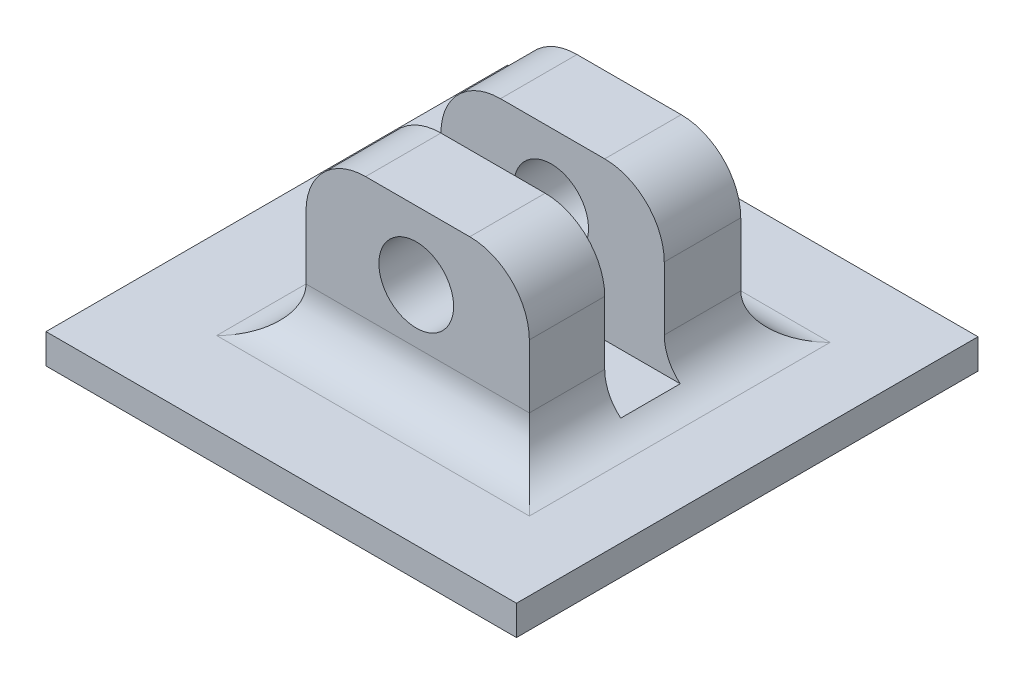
ISO-10303-21;
HEADER;
FILE_DESCRIPTION(('STEP AP214'),'2;1');
FILE_NAME('part.step','',(''),(''),'','','');
FILE_SCHEMA(('AUTOMOTIVE_DESIGN { 1 0 10303 214 1 1 1 1 }'));
ENDSEC;
DATA;
#1=APPLICATION_CONTEXT('core data for automotive mechanical design processes');
#2=APPLICATION_PROTOCOL_DEFINITION('international standard','automotive_design',2000,#1);
#3=PRODUCT_CONTEXT('',#1,'mechanical');
#4=PRODUCT('Part','Part','',(#3));
#5=PRODUCT_RELATED_PRODUCT_CATEGORY('part','',(#4));
#6=PRODUCT_DEFINITION_FORMATION('','',#4);
#7=PRODUCT_DEFINITION_CONTEXT('part definition',#1,'design');
#8=PRODUCT_DEFINITION('design','',#6,#7);
#9=PRODUCT_DEFINITION_SHAPE('','',#8);
#10=(LENGTH_UNIT() NAMED_UNIT(*) SI_UNIT(.MILLI.,.METRE.));
#11=(NAMED_UNIT(*) PLANE_ANGLE_UNIT() SI_UNIT($,.RADIAN.));
#12=(NAMED_UNIT(*) SI_UNIT($,.STERADIAN.) SOLID_ANGLE_UNIT());
#13=UNCERTAINTY_MEASURE_WITH_UNIT(LENGTH_MEASURE(1.E-05),#10,'distance_accuracy_value','');
#14=(GEOMETRIC_REPRESENTATION_CONTEXT(3) GLOBAL_UNCERTAINTY_ASSIGNED_CONTEXT((#13)) GLOBAL_UNIT_ASSIGNED_CONTEXT((#10,
#11,#12)) REPRESENTATION_CONTEXT('',''));
#15=CARTESIAN_POINT('',(0.,0.,0.));
#16=DIRECTION('',(0.,0.,1.));
#17=DIRECTION('',(1.,0.,0.));
#18=AXIS2_PLACEMENT_3D('',#15,#16,#17);
#19=CARTESIAN_POINT('',(3.50797955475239,0.,0.));
#20=DIRECTION('',(1.,0.,0.));
#21=DIRECTION('',(0.,0.,-1.));
#22=AXIS2_PLACEMENT_3D('',#19,#20,#21);
#23=PLANE('',#22);
#24=DIRECTION('',(0.,-1.,0.));
#25=VECTOR('',#24,1.);
#26=CARTESIAN_POINT('',(3.50797955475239,2.54,-23.5428929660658));
#27=LINE('',#26,#25);
#28=CARTESIAN_POINT('',(3.50797955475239,11.7440227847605,-23.5428929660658));
#29=VERTEX_POINT('',#28);
#30=CARTESIAN_POINT('',(3.50797955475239,6.35,-23.5428929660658));
#31=VERTEX_POINT('',#30);
#32=EDGE_CURVE('E241',#29,#31,#27,.T.);
#33=ORIENTED_EDGE('',*,*,#32,.T.);
#34=DIRECTION('',(0.,0.,1.));
#35=VECTOR('',#34,1.);
#36=CARTESIAN_POINT('',(3.50797955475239,6.35,-1.69889296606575));
#37=LINE('',#36,#35);
#38=CARTESIAN_POINT('',(3.50797955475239,6.35,-17.018));
#39=VERTEX_POINT('',#38);
#40=EDGE_CURVE('E327',#31,#39,#37,.T.);
#41=ORIENTED_EDGE('',*,*,#40,.T.);
#42=DIRECTION('',(0.,-1.,0.));
#43=VECTOR('',#42,1.);
#44=CARTESIAN_POINT('',(3.50797955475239,16.8240227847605,-17.018));
#45=LINE('',#44,#43);
#46=CARTESIAN_POINT('',(3.50797955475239,11.7440227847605,-17.018));
#47=VERTEX_POINT('',#46);
#48=EDGE_CURVE('E215',#47,#39,#45,.T.);
#49=ORIENTED_EDGE('',*,*,#48,.F.);
#50=DIRECTION('',(0.,0.,-1.));
#51=VECTOR('',#50,1.);
#52=CARTESIAN_POINT('',(3.50797955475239,11.7440227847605,-23.5428929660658));
#53=LINE('',#52,#51);
#54=EDGE_CURVE('E297',#47,#29,#53,.T.);
#55=ORIENTED_EDGE('',*,*,#54,.T.);
#56=EDGE_LOOP('',(#33,#41,#49,#55));
#57=FACE_BOUND('',#56,.T.);
#58=ADVANCED_FACE('F33',(#57),#23,.F.);
#59=CARTESIAN_POINT('',(22.5579795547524,0.,0.));
#60=DIRECTION('',(1.,0.,0.));
#61=DIRECTION('',(0.,0.,-1.));
#62=AXIS2_PLACEMENT_3D('',#59,#60,#61);
#63=PLANE('',#62);
#64=DIRECTION('',(0.,1.,0.));
#65=VECTOR('',#64,1.);
#66=CARTESIAN_POINT('',(22.5579795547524,2.54,-5.50889296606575));
#67=LINE('',#66,#65);
#68=CARTESIAN_POINT('',(22.5579795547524,6.35,-5.50889296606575));
#69=VERTEX_POINT('',#68);
#70=CARTESIAN_POINT('',(22.5579795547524,11.7440227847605,-5.50889296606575));
#71=VERTEX_POINT('',#70);
#72=EDGE_CURVE('E249',#69,#71,#67,.T.);
#73=ORIENTED_EDGE('',*,*,#72,.F.);
#74=DIRECTION('',(0.,0.,1.));
#75=VECTOR('',#74,1.);
#76=CARTESIAN_POINT('',(22.5579795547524,6.35,0.));
#77=LINE('',#76,#75);
#78=CARTESIAN_POINT('',(22.5579795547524,6.35,-11.938));
#79=VERTEX_POINT('',#78);
#80=EDGE_CURVE('E310',#69,#79,#77,.F.);
#81=ORIENTED_EDGE('',*,*,#80,.T.);
#82=DIRECTION('',(0.,-1.,0.));
#83=VECTOR('',#82,1.);
#84=CARTESIAN_POINT('',(22.5579795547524,0.,-11.938));
#85=LINE('',#84,#83);
#86=CARTESIAN_POINT('',(22.5579795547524,11.7440227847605,-11.938));
#87=VERTEX_POINT('',#86);
#88=EDGE_CURVE('E229',#87,#79,#85,.T.);
#89=ORIENTED_EDGE('',*,*,#88,.F.);
#90=DIRECTION('',(0.,0.,-1.));
#91=VECTOR('',#90,1.);
#92=CARTESIAN_POINT('',(22.5579795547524,11.7440227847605,0.));
#93=LINE('',#92,#91);
#94=EDGE_CURVE('E273',#87,#71,#93,.F.);
#95=ORIENTED_EDGE('',*,*,#94,.T.);
#96=EDGE_LOOP('',(#73,#81,#89,#95));
#97=FACE_BOUND('',#96,.T.);
#98=ADVANCED_FACE('F362',(#97),#63,.T.);
#99=CARTESIAN_POINT('',(7.82597955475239,16.8240227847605,-23.5428929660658));
#100=DIRECTION('',(0.,1.,0.));
#101=DIRECTION('',(0.,0.,1.));
#102=AXIS2_PLACEMENT_3D('',#99,#100,#101);
#103=PLANE('',#102);
#104=DIRECTION('',(-1.,0.,0.));
#105=VECTOR('',#104,1.);
#106=CARTESIAN_POINT('',(25.6059795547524,16.8240227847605,-17.018));
#107=LINE('',#106,#105);
#108=CARTESIAN_POINT('',(17.4779795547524,16.8240227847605,-17.018));
#109=VERTEX_POINT('',#108);
#110=CARTESIAN_POINT('',(8.58797955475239,16.8240227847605,-17.018));
#111=VERTEX_POINT('',#110);
#112=EDGE_CURVE('E220',#109,#111,#107,.T.);
#113=ORIENTED_EDGE('',*,*,#112,.F.);
#114=DIRECTION('',(0.,0.,-1.));
#115=VECTOR('',#114,1.);
#116=CARTESIAN_POINT('',(17.4779795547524,16.8240227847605,-23.5428929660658));
#117=LINE('',#116,#115);
#118=CARTESIAN_POINT('',(17.4779795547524,16.8240227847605,-23.5428929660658));
#119=VERTEX_POINT('',#118);
#120=EDGE_CURVE('E283',#109,#119,#117,.T.);
#121=ORIENTED_EDGE('',*,*,#120,.T.);
#122=DIRECTION('',(-1.,0.,0.));
#123=VECTOR('',#122,1.);
#124=CARTESIAN_POINT('',(7.82597955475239,16.8240227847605,-23.5428929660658));
#125=LINE('',#124,#123);
#126=CARTESIAN_POINT('',(8.58797955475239,16.8240227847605,-23.5428929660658));
#127=VERTEX_POINT('',#126);
#128=EDGE_CURVE('E254',#119,#127,#125,.T.);
#129=ORIENTED_EDGE('',*,*,#128,.T.);
#130=DIRECTION('',(0.,0.,-1.));
#131=VECTOR('',#130,1.);
#132=CARTESIAN_POINT('',(8.58797955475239,16.8240227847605,-17.018));
#133=LINE('',#132,#131);
#134=EDGE_CURVE('E281',#127,#111,#133,.F.);
#135=ORIENTED_EDGE('',*,*,#134,.T.);
#136=EDGE_LOOP('',(#113,#121,#129,#135));
#137=FACE_BOUND('',#136,.T.);
#138=ADVANCED_FACE('F401',(#137),#103,.T.);
#139=CARTESIAN_POINT('',(12.9105101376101,10.9830853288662,-27.6068929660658));
#140=DIRECTION('',(0.,0.,1.));
#141=DIRECTION('',(1.,0.,0.));
#142=AXIS2_PLACEMENT_3D('',#139,#140,#141);
#143=CYLINDRICAL_SURFACE('',#142,3.1877);
#144=CARTESIAN_POINT('',(12.9105101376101,10.9830853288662,-17.018));
#145=DIRECTION('',(0.,0.,-1.));
#146=DIRECTION('',(-1.,0.,0.));
#147=AXIS2_PLACEMENT_3D('',#144,#145,#146);
#148=CIRCLE('',#147,3.1877);
#149=CARTESIAN_POINT('',(9.72281013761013,10.9830853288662,-17.018));
#150=VERTEX_POINT('',#149);
#151=EDGE_CURVE('E232',#150,#150,#148,.F.);
#152=ORIENTED_EDGE('',*,*,#151,.T.);
#153=EDGE_LOOP('',(#152));
#154=FACE_BOUND('',#153,.T.);
#155=CARTESIAN_POINT('',(12.9105101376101,10.9830853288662,-23.5428929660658));
#156=DIRECTION('',(0.,0.,-1.));
#157=DIRECTION('',(-1.,0.,0.));
#158=AXIS2_PLACEMENT_3D('',#155,#156,#157);
#159=CIRCLE('',#158,3.1877);
#160=CARTESIAN_POINT('',(9.72281013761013,10.9830853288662,-23.5428929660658));
#161=VERTEX_POINT('',#160);
#162=EDGE_CURVE('E238',#161,#161,#159,.T.);
#163=ORIENTED_EDGE('',*,*,#162,.T.);
#164=EDGE_LOOP('',(#163));
#165=FACE_BOUND('',#164,.T.);
#166=ADVANCED_FACE('F419',(#154,#165),#143,.F.);
#167=CARTESIAN_POINT('',(0.,2.54,0.));
#168=DIRECTION('',(0.,-1.,0.));
#169=DIRECTION('',(0.,0.,-1.));
#170=AXIS2_PLACEMENT_3D('',#167,#168,#169);
#171=PLANE('',#170);
#172=DIRECTION('',(1.,0.,0.));
#173=VECTOR('',#172,1.);
#174=CARTESIAN_POINT('',(0.,2.54,-27.3528929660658));
#175=LINE('',#174,#173);
#176=CARTESIAN_POINT('',(-0.302020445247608,2.54,-27.3528929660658));
#177=VERTEX_POINT('',#176);
#178=CARTESIAN_POINT('',(26.3679795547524,2.54,-27.3528929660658));
#179=VERTEX_POINT('',#178);
#180=EDGE_CURVE('E320',#177,#179,#175,.T.);
#181=ORIENTED_EDGE('',*,*,#180,.T.);
#182=DIRECTION('',(0.,0.,1.));
#183=VECTOR('',#182,1.);
#184=CARTESIAN_POINT('',(26.3679795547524,2.54,0.));
#185=LINE('',#184,#183);
#186=CARTESIAN_POINT('',(26.3679795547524,2.54,-1.69889296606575));
#187=VERTEX_POINT('',#186);
#188=EDGE_CURVE('E303',#179,#187,#185,.T.);
#189=ORIENTED_EDGE('',*,*,#188,.T.);
#190=DIRECTION('',(1.,0.,0.));
#191=VECTOR('',#190,1.);
#192=CARTESIAN_POINT('',(3.50797955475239,2.54,-1.69889296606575));
#193=LINE('',#192,#191);
#194=CARTESIAN_POINT('',(-0.302020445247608,2.54,-1.69889296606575));
#195=VERTEX_POINT('',#194);
#196=EDGE_CURVE('E305',#187,#195,#193,.F.);
#197=ORIENTED_EDGE('',*,*,#196,.T.);
#198=DIRECTION('',(0.,0.,1.));
#199=VECTOR('',#198,1.);
#200=CARTESIAN_POINT('',(-0.302020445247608,2.54,-23.5428929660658));
#201=LINE('',#200,#199);
#202=EDGE_CURVE('E317',#195,#177,#201,.F.);
#203=ORIENTED_EDGE('',*,*,#202,.T.);
#204=EDGE_LOOP('',(#181,#189,#197,#203));
#205=FACE_BOUND('',#204,.T.);
#206=DIRECTION('',(-1.,0.,0.));
#207=VECTOR('',#206,1.);
#208=CARTESIAN_POINT('',(0.,2.54,-34.0808899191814));
#209=LINE('',#208,#207);
#210=CARTESIAN_POINT('',(32.258,2.54,-34.0808899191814));
#211=VERTEX_POINT('',#210);
#212=CARTESIAN_POINT('',(-7.87399999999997,2.54,-34.0808899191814));
#213=VERTEX_POINT('',#212);
#214=EDGE_CURVE('E187',#211,#213,#209,.T.);
#215=ORIENTED_EDGE('',*,*,#214,.T.);
#216=DIRECTION('',(0.,0.,-1.));
#217=VECTOR('',#216,1.);
#218=CARTESIAN_POINT('',(-7.874,2.54,5.28911008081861));
#219=LINE('',#218,#217);
#220=CARTESIAN_POINT('',(-7.874,2.54,5.28911008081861));
#221=VERTEX_POINT('',#220);
#222=EDGE_CURVE('E185',#221,#213,#219,.T.);
#223=ORIENTED_EDGE('',*,*,#222,.F.);
#224=DIRECTION('',(-1.,0.,0.));
#225=VECTOR('',#224,1.);
#226=CARTESIAN_POINT('',(0.,2.54,5.28911008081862));
#227=LINE('',#226,#225);
#228=CARTESIAN_POINT('',(32.258,2.54,5.28911008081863));
#229=VERTEX_POINT('',#228);
#230=EDGE_CURVE('E171',#229,#221,#227,.T.);
#231=ORIENTED_EDGE('',*,*,#230,.F.);
#232=DIRECTION('',(0.,0.,-1.));
#233=VECTOR('',#232,1.);
#234=CARTESIAN_POINT('',(32.258,2.54,5.28911008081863));
#235=LINE('',#234,#233);
#236=EDGE_CURVE('E204',#229,#211,#235,.T.);
#237=ORIENTED_EDGE('',*,*,#236,.T.);
#238=EDGE_LOOP('',(#215,#223,#231,#237));
#239=FACE_BOUND('',#238,.T.);
#240=ADVANCED_FACE('F186',(#205,#239),#171,.F.);
#241=CARTESIAN_POINT('',(0.,0.,0.));
#242=DIRECTION('',(0.,-1.,0.));
#243=DIRECTION('',(0.,0.,-1.));
#244=AXIS2_PLACEMENT_3D('',#241,#242,#243);
#245=PLANE('',#244);
#246=DIRECTION('',(1.,0.,0.));
#247=VECTOR('',#246,1.);
#248=CARTESIAN_POINT('',(0.,0.,-34.0808899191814));
#249=LINE('',#248,#247);
#250=CARTESIAN_POINT('',(-7.87399999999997,0.,-34.0808899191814));
#251=VERTEX_POINT('',#250);
#252=CARTESIAN_POINT('',(32.258,0.,-34.0808899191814));
#253=VERTEX_POINT('',#252);
#254=EDGE_CURVE('E181',#251,#253,#249,.T.);
#255=ORIENTED_EDGE('',*,*,#254,.T.);
#256=DIRECTION('',(0.,0.,1.));
#257=VECTOR('',#256,1.);
#258=CARTESIAN_POINT('',(32.258,0.,5.28911008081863));
#259=LINE('',#258,#257);
#260=CARTESIAN_POINT('',(32.258,0.,5.28911008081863));
#261=VERTEX_POINT('',#260);
#262=EDGE_CURVE('E209',#253,#261,#259,.T.);
#263=ORIENTED_EDGE('',*,*,#262,.T.);
#264=DIRECTION('',(1.,0.,0.));
#265=VECTOR('',#264,1.);
#266=CARTESIAN_POINT('',(0.,0.,5.28911008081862));
#267=LINE('',#266,#265);
#268=CARTESIAN_POINT('',(-7.874,0.,5.28911008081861));
#269=VERTEX_POINT('',#268);
#270=EDGE_CURVE('E182',#269,#261,#267,.T.);
#271=ORIENTED_EDGE('',*,*,#270,.F.);
#272=DIRECTION('',(0.,0.,1.));
#273=VECTOR('',#272,1.);
#274=CARTESIAN_POINT('',(-7.874,0.,5.28911008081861));
#275=LINE('',#274,#273);
#276=EDGE_CURVE('E196',#251,#269,#275,.T.);
#277=ORIENTED_EDGE('',*,*,#276,.F.);
#278=EDGE_LOOP('',(#255,#263,#271,#277));
#279=FACE_BOUND('',#278,.T.);
#280=ADVANCED_FACE('F418',(#279),#245,.T.);
#281=DIRECTION('',(-1.,0.,0.));
#282=VECTOR('',#281,1.);
#283=CARTESIAN_POINT('',(7.82597955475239,16.8240227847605,-5.50889296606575));
#284=LINE('',#283,#282);
#285=CARTESIAN_POINT('',(17.4779795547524,16.8240227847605,-5.50889296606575));
#286=VERTEX_POINT('',#285);
#287=CARTESIAN_POINT('',(8.58797955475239,16.8240227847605,-5.50889296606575));
#288=VERTEX_POINT('',#287);
#289=EDGE_CURVE('E251',#286,#288,#284,.T.);
#290=ORIENTED_EDGE('',*,*,#289,.F.);
#291=DIRECTION('',(0.,0.,-1.));
#292=VECTOR('',#291,1.);
#293=CARTESIAN_POINT('',(17.4779795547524,16.8240227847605,-23.5428929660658));
#294=LINE('',#293,#292);
#295=CARTESIAN_POINT('',(17.4779795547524,16.8240227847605,-11.938));
#296=VERTEX_POINT('',#295);
#297=EDGE_CURVE('E263',#286,#296,#294,.T.);
#298=ORIENTED_EDGE('',*,*,#297,.T.);
#299=DIRECTION('',(-1.,0.,0.));
#300=VECTOR('',#299,1.);
#301=CARTESIAN_POINT('',(25.6059795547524,16.8240227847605,-11.938));
#302=LINE('',#301,#300);
#303=CARTESIAN_POINT('',(8.58797955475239,16.8240227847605,-11.938));
#304=VERTEX_POINT('',#303);
#305=EDGE_CURVE('E224',#296,#304,#302,.T.);
#306=ORIENTED_EDGE('',*,*,#305,.T.);
#307=DIRECTION('',(0.,0.,-1.));
#308=VECTOR('',#307,1.);
#309=CARTESIAN_POINT('',(8.58797955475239,16.8240227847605,-5.50889296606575));
#310=LINE('',#309,#308);
#311=EDGE_CURVE('E257',#304,#288,#310,.F.);
#312=ORIENTED_EDGE('',*,*,#311,.T.);
#313=EDGE_LOOP('',(#290,#298,#306,#312));
#314=FACE_BOUND('',#313,.T.);
#315=ADVANCED_FACE('F372',(#314),#103,.T.);
#316=CARTESIAN_POINT('',(0.,0.,-23.5428929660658));
#317=DIRECTION('',(0.,0.,-1.));
#318=DIRECTION('',(-1.,0.,0.));
#319=AXIS2_PLACEMENT_3D('',#316,#317,#318);
#320=PLANE('',#319);
#321=ORIENTED_EDGE('',*,*,#162,.F.);
#322=EDGE_LOOP('',(#321));
#323=FACE_BOUND('',#322,.T.);
#324=DIRECTION('',(0.,-1.,0.));
#325=VECTOR('',#324,1.);
#326=CARTESIAN_POINT('',(22.5579795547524,2.54,-23.5428929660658));
#327=LINE('',#326,#325);
#328=CARTESIAN_POINT('',(22.5579795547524,11.7440227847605,-23.5428929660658));
#329=VERTEX_POINT('',#328);
#330=CARTESIAN_POINT('',(22.5579795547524,6.35,-23.5428929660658));
#331=VERTEX_POINT('',#330);
#332=EDGE_CURVE('E246',#329,#331,#327,.T.);
#333=ORIENTED_EDGE('',*,*,#332,.T.);
#334=DIRECTION('',(1.,0.,0.));
#335=VECTOR('',#334,1.);
#336=CARTESIAN_POINT('',(0.,6.35,-23.5428929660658));
#337=LINE('',#336,#335);
#338=EDGE_CURVE('E323',#331,#31,#337,.F.);
#339=ORIENTED_EDGE('',*,*,#338,.T.);
#340=ORIENTED_EDGE('',*,*,#32,.F.);
#341=CARTESIAN_POINT('',(8.58797955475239,11.7440227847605,-23.5428929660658));
#342=DIRECTION('',(0.,0.,-1.));
#343=DIRECTION('',(-1.,0.,0.));
#344=AXIS2_PLACEMENT_3D('',#341,#342,#343);
#345=CIRCLE('',#344,5.08);
#346=EDGE_CURVE('E286',#29,#127,#345,.T.);
#347=ORIENTED_EDGE('',*,*,#346,.T.);
#348=ORIENTED_EDGE('',*,*,#128,.F.);
#349=CARTESIAN_POINT('',(17.4779795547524,11.7440227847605,-23.5428929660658));
#350=DIRECTION('',(0.,0.,-1.));
#351=DIRECTION('',(-1.,0.,0.));
#352=AXIS2_PLACEMENT_3D('',#349,#350,#351);
#353=CIRCLE('',#352,5.08);
#354=EDGE_CURVE('E288',#119,#329,#353,.T.);
#355=ORIENTED_EDGE('',*,*,#354,.T.);
#356=EDGE_LOOP('',(#333,#339,#340,#347,#348,#355));
#357=FACE_BOUND('',#356,.T.);
#358=ADVANCED_FACE('F398',(#323,#357),#320,.T.);
#359=CARTESIAN_POINT('',(0.,0.,-5.50889296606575));
#360=DIRECTION('',(0.,0.,-1.));
#361=DIRECTION('',(-1.,0.,0.));
#362=AXIS2_PLACEMENT_3D('',#359,#360,#361);
#363=PLANE('',#362);
#364=CARTESIAN_POINT('',(12.9105101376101,10.9830853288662,-5.50889296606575));
#365=DIRECTION('',(0.,0.,1.));
#366=DIRECTION('',(1.,0.,0.));
#367=AXIS2_PLACEMENT_3D('',#364,#365,#366);
#368=CIRCLE('',#367,3.1877);
#369=CARTESIAN_POINT('',(16.0982101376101,10.9830853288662,-5.50889296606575));
#370=VERTEX_POINT('',#369);
#371=EDGE_CURVE('E235',#370,#370,#368,.T.);
#372=ORIENTED_EDGE('',*,*,#371,.F.);
#373=EDGE_LOOP('',(#372));
#374=FACE_BOUND('',#373,.T.);
#375=DIRECTION('',(0.,1.,0.));
#376=VECTOR('',#375,1.);
#377=CARTESIAN_POINT('',(3.50797955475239,2.54,-5.50889296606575));
#378=LINE('',#377,#376);
#379=CARTESIAN_POINT('',(3.50797955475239,6.35,-5.50889296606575));
#380=VERTEX_POINT('',#379);
#381=CARTESIAN_POINT('',(3.50797955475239,11.7440227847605,-5.50889296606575));
#382=VERTEX_POINT('',#381);
#383=EDGE_CURVE('E244',#380,#382,#378,.T.);
#384=ORIENTED_EDGE('',*,*,#383,.F.);
#385=DIRECTION('',(1.,0.,0.));
#386=VECTOR('',#385,1.);
#387=CARTESIAN_POINT('',(22.5579795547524,6.35,-5.50889296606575));
#388=LINE('',#387,#386);
#389=EDGE_CURVE('E300',#380,#69,#388,.T.);
#390=ORIENTED_EDGE('',*,*,#389,.T.);
#391=ORIENTED_EDGE('',*,*,#72,.T.);
#392=CARTESIAN_POINT('',(17.4779795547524,11.7440227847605,-5.50889296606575));
#393=DIRECTION('',(0.,0.,-1.));
#394=DIRECTION('',(-1.,0.,0.));
#395=AXIS2_PLACEMENT_3D('',#392,#393,#394);
#396=CIRCLE('',#395,5.08);
#397=EDGE_CURVE('E279',#71,#286,#396,.F.);
#398=ORIENTED_EDGE('',*,*,#397,.T.);
#399=ORIENTED_EDGE('',*,*,#289,.T.);
#400=CARTESIAN_POINT('',(8.58797955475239,11.7440227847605,-5.50889296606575));
#401=DIRECTION('',(0.,0.,-1.));
#402=DIRECTION('',(-1.,0.,0.));
#403=AXIS2_PLACEMENT_3D('',#400,#401,#402);
#404=CIRCLE('',#403,5.08);
#405=EDGE_CURVE('E276',#288,#382,#404,.F.);
#406=ORIENTED_EDGE('',*,*,#405,.T.);
#407=EDGE_LOOP('',(#384,#390,#391,#398,#399,#406));
#408=FACE_BOUND('',#407,.T.);
#409=ADVANCED_FACE('F360',(#374,#408),#363,.F.);
#410=DIRECTION('',(0.,1.,0.));
#411=VECTOR('',#410,1.);
#412=CARTESIAN_POINT('',(3.50797955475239,16.8240227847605,-11.938));
#413=LINE('',#412,#411);
#414=CARTESIAN_POINT('',(3.50797955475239,6.35,-11.938));
#415=VERTEX_POINT('',#414);
#416=CARTESIAN_POINT('',(3.50797955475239,11.7440227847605,-11.938));
#417=VERTEX_POINT('',#416);
#418=EDGE_CURVE('E218',#415,#417,#413,.T.);
#419=ORIENTED_EDGE('',*,*,#418,.F.);
#420=DIRECTION('',(0.,0.,1.));
#421=VECTOR('',#420,1.);
#422=CARTESIAN_POINT('',(3.50797955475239,6.35,-1.69889296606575));
#423=LINE('',#422,#421);
#424=EDGE_CURVE('E325',#415,#380,#423,.T.);
#425=ORIENTED_EDGE('',*,*,#424,.T.);
#426=ORIENTED_EDGE('',*,*,#383,.T.);
#427=DIRECTION('',(0.,0.,-1.));
#428=VECTOR('',#427,1.);
#429=CARTESIAN_POINT('',(3.50797955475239,11.7440227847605,-11.938));
#430=LINE('',#429,#428);
#431=EDGE_CURVE('E294',#382,#417,#430,.T.);
#432=ORIENTED_EDGE('',*,*,#431,.T.);
#433=EDGE_LOOP('',(#419,#425,#426,#432));
#434=FACE_BOUND('',#433,.T.);
#435=ADVANCED_FACE('F345',(#434),#23,.F.);
#436=DIRECTION('',(0.,1.,0.));
#437=VECTOR('',#436,1.);
#438=CARTESIAN_POINT('',(22.5579795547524,0.,-17.018));
#439=LINE('',#438,#437);
#440=CARTESIAN_POINT('',(22.5579795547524,6.35,-17.018));
#441=VERTEX_POINT('',#440);
#442=CARTESIAN_POINT('',(22.5579795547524,11.7440227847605,-17.018));
#443=VERTEX_POINT('',#442);
#444=EDGE_CURVE('E233',#441,#443,#439,.T.);
#445=ORIENTED_EDGE('',*,*,#444,.F.);
#446=DIRECTION('',(0.,0.,1.));
#447=VECTOR('',#446,1.);
#448=CARTESIAN_POINT('',(22.5579795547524,6.35,0.));
#449=LINE('',#448,#447);
#450=EDGE_CURVE('E307',#441,#331,#449,.F.);
#451=ORIENTED_EDGE('',*,*,#450,.T.);
#452=ORIENTED_EDGE('',*,*,#332,.F.);
#453=DIRECTION('',(0.,0.,-1.));
#454=VECTOR('',#453,1.);
#455=CARTESIAN_POINT('',(22.5579795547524,11.7440227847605,0.));
#456=LINE('',#455,#454);
#457=EDGE_CURVE('E270',#329,#443,#456,.F.);
#458=ORIENTED_EDGE('',*,*,#457,.T.);
#459=EDGE_LOOP('',(#445,#451,#452,#458));
#460=FACE_BOUND('',#459,.T.);
#461=ADVANCED_FACE('F411',(#460),#63,.T.);
#462=CARTESIAN_POINT('',(12.9105101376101,10.9830853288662,-11.938));
#463=DIRECTION('',(0.,0.,1.));
#464=DIRECTION('',(1.,0.,0.));
#465=AXIS2_PLACEMENT_3D('',#462,#463,#464);
#466=CIRCLE('',#465,3.1877);
#467=CARTESIAN_POINT('',(16.0982101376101,10.9830853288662,-11.938));
#468=VERTEX_POINT('',#467);
#469=EDGE_CURVE('E223',#468,#468,#466,.F.);
#470=ORIENTED_EDGE('',*,*,#469,.T.);
#471=EDGE_LOOP('',(#470));
#472=FACE_BOUND('',#471,.T.);
#473=ORIENTED_EDGE('',*,*,#371,.T.);
#474=EDGE_LOOP('',(#473));
#475=FACE_BOUND('',#474,.T.);
#476=ADVANCED_FACE('F429',(#472,#475),#143,.F.);
#477=CARTESIAN_POINT('',(25.6059795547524,16.8240227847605,-17.018));
#478=DIRECTION('',(0.,0.,-1.));
#479=DIRECTION('',(-1.,0.,0.));
#480=AXIS2_PLACEMENT_3D('',#477,#478,#479);
#481=PLANE('',#480);
#482=DIRECTION('',(-1.,0.,0.));
#483=VECTOR('',#482,1.);
#484=CARTESIAN_POINT('',(25.6059795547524,3.429,-17.018));
#485=LINE('',#484,#483);
#486=CARTESIAN_POINT('',(23.9217867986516,3.429,-17.018));
#487=VERTEX_POINT('',#486);
#488=CARTESIAN_POINT('',(2.14417231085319,3.429,-17.018));
#489=VERTEX_POINT('',#488);
#490=EDGE_CURVE('E56',#487,#489,#485,.T.);
#491=ORIENTED_EDGE('',*,*,#490,.F.);
#492=CARTESIAN_POINT('',(26.3679795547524,6.35,-17.018));
#493=DIRECTION('',(0.,0.,-1.));
#494=DIRECTION('',(-1.,0.,0.));
#495=AXIS2_PLACEMENT_3D('',#492,#493,#494);
#496=CIRCLE('',#495,3.81);
#497=EDGE_CURVE('E316',#487,#441,#496,.T.);
#498=ORIENTED_EDGE('',*,*,#497,.T.);
#499=ORIENTED_EDGE('',*,*,#444,.T.);
#500=CARTESIAN_POINT('',(17.4779795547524,11.7440227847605,-17.018));
#501=DIRECTION('',(0.,0.,-1.));
#502=DIRECTION('',(-1.,0.,0.));
#503=AXIS2_PLACEMENT_3D('',#500,#501,#502);
#504=CIRCLE('',#503,5.08);
#505=EDGE_CURVE('E292',#443,#109,#504,.F.);
#506=ORIENTED_EDGE('',*,*,#505,.T.);
#507=ORIENTED_EDGE('',*,*,#112,.T.);
#508=CARTESIAN_POINT('',(8.58797955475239,11.7440227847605,-17.018));
#509=DIRECTION('',(0.,0.,-1.));
#510=DIRECTION('',(-1.,0.,0.));
#511=AXIS2_PLACEMENT_3D('',#508,#509,#510);
#512=CIRCLE('',#511,5.08);
#513=EDGE_CURVE('E290',#111,#47,#512,.F.);
#514=ORIENTED_EDGE('',*,*,#513,.T.);
#515=ORIENTED_EDGE('',*,*,#48,.T.);
#516=CARTESIAN_POINT('',(-0.302020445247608,6.35,-17.018));
#517=DIRECTION('',(0.,0.,-1.));
#518=DIRECTION('',(-1.,0.,0.));
#519=AXIS2_PLACEMENT_3D('',#516,#517,#518);
#520=CIRCLE('',#519,3.81);
#521=EDGE_CURVE('E331',#39,#489,#520,.T.);
#522=ORIENTED_EDGE('',*,*,#521,.T.);
#523=EDGE_LOOP('',(#491,#498,#499,#506,#507,#514,#515,#522));
#524=FACE_BOUND('',#523,.T.);
#525=ORIENTED_EDGE('',*,*,#151,.F.);
#526=EDGE_LOOP('',(#525));
#527=FACE_BOUND('',#526,.T.);
#528=ADVANCED_FACE('F386',(#524,#527),#481,.F.);
#529=CARTESIAN_POINT('',(25.6059795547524,16.8240227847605,-11.938));
#530=DIRECTION('',(0.,0.,1.));
#531=DIRECTION('',(1.,0.,0.));
#532=AXIS2_PLACEMENT_3D('',#529,#530,#531);
#533=PLANE('',#532);
#534=ORIENTED_EDGE('',*,*,#305,.F.);
#535=CARTESIAN_POINT('',(17.4779795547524,11.7440227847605,-11.938));
#536=DIRECTION('',(0.,0.,1.));
#537=DIRECTION('',(1.,0.,0.));
#538=AXIS2_PLACEMENT_3D('',#535,#536,#537);
#539=CIRCLE('',#538,5.08);
#540=EDGE_CURVE('E268',#296,#87,#539,.F.);
#541=ORIENTED_EDGE('',*,*,#540,.T.);
#542=ORIENTED_EDGE('',*,*,#88,.T.);
#543=CARTESIAN_POINT('',(26.3679795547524,6.35,-11.938));
#544=DIRECTION('',(0.,0.,1.));
#545=DIRECTION('',(1.,0.,0.));
#546=AXIS2_PLACEMENT_3D('',#543,#544,#545);
#547=CIRCLE('',#546,3.81);
#548=CARTESIAN_POINT('',(23.9217867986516,3.429,-11.938));
#549=VERTEX_POINT('',#548);
#550=EDGE_CURVE('E312',#79,#549,#547,.T.);
#551=ORIENTED_EDGE('',*,*,#550,.T.);
#552=DIRECTION('',(-1.,0.,0.));
#553=VECTOR('',#552,1.);
#554=CARTESIAN_POINT('',(25.6059795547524,3.429,-11.938));
#555=LINE('',#554,#553);
#556=CARTESIAN_POINT('',(2.14417231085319,3.429,-11.938));
#557=VERTEX_POINT('',#556);
#558=EDGE_CURVE('E49',#549,#557,#555,.T.);
#559=ORIENTED_EDGE('',*,*,#558,.T.);
#560=CARTESIAN_POINT('',(-0.302020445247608,6.35,-11.938));
#561=DIRECTION('',(0.,0.,1.));
#562=DIRECTION('',(1.,0.,0.));
#563=AXIS2_PLACEMENT_3D('',#560,#561,#562);
#564=CIRCLE('',#563,3.81);
#565=EDGE_CURVE('E42',#557,#415,#564,.T.);
#566=ORIENTED_EDGE('',*,*,#565,.T.);
#567=ORIENTED_EDGE('',*,*,#418,.T.);
#568=CARTESIAN_POINT('',(8.58797955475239,11.7440227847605,-11.938));
#569=DIRECTION('',(0.,0.,1.));
#570=DIRECTION('',(1.,0.,0.));
#571=AXIS2_PLACEMENT_3D('',#568,#569,#570);
#572=CIRCLE('',#571,5.08);
#573=EDGE_CURVE('E266',#417,#304,#572,.F.);
#574=ORIENTED_EDGE('',*,*,#573,.T.);
#575=EDGE_LOOP('',(#534,#541,#542,#551,#559,#566,#567,#574));
#576=FACE_BOUND('',#575,.T.);
#577=ORIENTED_EDGE('',*,*,#469,.F.);
#578=EDGE_LOOP('',(#577));
#579=FACE_BOUND('',#578,.T.);
#580=ADVANCED_FACE('F338',(#576,#579),#533,.F.);
#581=CARTESIAN_POINT('',(25.6059795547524,3.429,-17.018));
#582=DIRECTION('',(0.,-1.,0.));
#583=DIRECTION('',(0.,0.,-1.));
#584=AXIS2_PLACEMENT_3D('',#581,#582,#583);
#585=PLANE('',#584);
#586=ORIENTED_EDGE('',*,*,#558,.F.);
#587=DIRECTION('',(0.,0.,1.));
#588=VECTOR('',#587,1.);
#589=CARTESIAN_POINT('',(23.9217867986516,3.429,-11.938));
#590=LINE('',#589,#588);
#591=EDGE_CURVE('E314',#549,#487,#590,.F.);
#592=ORIENTED_EDGE('',*,*,#591,.T.);
#593=ORIENTED_EDGE('',*,*,#490,.T.);
#594=DIRECTION('',(0.,0.,-1.));
#595=VECTOR('',#594,1.);
#596=CARTESIAN_POINT('',(2.14417231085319,3.429,-17.018));
#597=LINE('',#596,#595);
#598=EDGE_CURVE('E333',#489,#557,#597,.F.);
#599=ORIENTED_EDGE('',*,*,#598,.T.);
#600=EDGE_LOOP('',(#586,#592,#593,#599));
#601=FACE_BOUND('',#600,.T.);
#602=ADVANCED_FACE('F382',(#601),#585,.F.);
#603=CARTESIAN_POINT('',(17.4779795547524,11.7440227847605,-23.5428929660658));
#604=DIRECTION('',(0.,0.,-1.));
#605=DIRECTION('',(-1.,0.,0.));
#606=AXIS2_PLACEMENT_3D('',#603,#604,#605);
#607=CYLINDRICAL_SURFACE('',#606,5.08);
#608=ORIENTED_EDGE('',*,*,#397,.F.);
#609=ORIENTED_EDGE('',*,*,#94,.F.);
#610=ORIENTED_EDGE('',*,*,#540,.F.);
#611=ORIENTED_EDGE('',*,*,#297,.F.);
#612=EDGE_LOOP('',(#608,#609,#610,#611));
#613=FACE_BOUND('',#612,.T.);
#614=ADVANCED_FACE('F368',(#613),#607,.T.);
#615=CARTESIAN_POINT('',(17.4779795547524,11.7440227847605,-23.5428929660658));
#616=DIRECTION('',(0.,0.,-1.));
#617=DIRECTION('',(-1.,0.,0.));
#618=AXIS2_PLACEMENT_3D('',#615,#616,#617);
#619=CYLINDRICAL_SURFACE('',#618,5.08);
#620=ORIENTED_EDGE('',*,*,#505,.F.);
#621=ORIENTED_EDGE('',*,*,#457,.F.);
#622=ORIENTED_EDGE('',*,*,#354,.F.);
#623=ORIENTED_EDGE('',*,*,#120,.F.);
#624=EDGE_LOOP('',(#620,#621,#622,#623));
#625=FACE_BOUND('',#624,.T.);
#626=ADVANCED_FACE('F405',(#625),#619,.T.);
#627=CARTESIAN_POINT('',(8.58797955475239,11.7440227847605,0.));
#628=DIRECTION('',(0.,0.,1.));
#629=DIRECTION('',(1.,0.,0.));
#630=AXIS2_PLACEMENT_3D('',#627,#628,#629);
#631=CYLINDRICAL_SURFACE('',#630,5.08);
#632=ORIENTED_EDGE('',*,*,#513,.F.);
#633=ORIENTED_EDGE('',*,*,#134,.F.);
#634=ORIENTED_EDGE('',*,*,#346,.F.);
#635=ORIENTED_EDGE('',*,*,#54,.F.);
#636=EDGE_LOOP('',(#632,#633,#634,#635));
#637=FACE_BOUND('',#636,.T.);
#638=ADVANCED_FACE('F394',(#637),#631,.T.);
#639=CARTESIAN_POINT('',(8.58797955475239,11.7440227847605,0.));
#640=DIRECTION('',(0.,0.,1.));
#641=DIRECTION('',(1.,0.,0.));
#642=AXIS2_PLACEMENT_3D('',#639,#640,#641);
#643=CYLINDRICAL_SURFACE('',#642,5.08);
#644=ORIENTED_EDGE('',*,*,#405,.F.);
#645=ORIENTED_EDGE('',*,*,#311,.F.);
#646=ORIENTED_EDGE('',*,*,#573,.F.);
#647=ORIENTED_EDGE('',*,*,#431,.F.);
#648=EDGE_LOOP('',(#644,#645,#646,#647));
#649=FACE_BOUND('',#648,.T.);
#650=ADVANCED_FACE('F375',(#649),#643,.T.);
#651=CARTESIAN_POINT('',(0.,0.,5.28911008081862));
#652=DIRECTION('',(0.,0.,1.));
#653=DIRECTION('',(1.,0.,0.));
#654=AXIS2_PLACEMENT_3D('',#651,#652,#653);
#655=PLANE('',#654);
#656=ORIENTED_EDGE('',*,*,#230,.T.);
#657=DIRECTION('',(0.,1.,0.));
#658=VECTOR('',#657,1.);
#659=CARTESIAN_POINT('',(-7.874,0.,5.28911008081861));
#660=LINE('',#659,#658);
#661=EDGE_CURVE('E175',#269,#221,#660,.T.);
#662=ORIENTED_EDGE('',*,*,#661,.F.);
#663=ORIENTED_EDGE('',*,*,#270,.T.);
#664=DIRECTION('',(0.,1.,0.));
#665=VECTOR('',#664,1.);
#666=CARTESIAN_POINT('',(32.258,0.,5.28911008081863));
#667=LINE('',#666,#665);
#668=EDGE_CURVE('E177',#261,#229,#667,.T.);
#669=ORIENTED_EDGE('',*,*,#668,.T.);
#670=EDGE_LOOP('',(#656,#662,#663,#669));
#671=FACE_BOUND('',#670,.T.);
#672=ADVANCED_FACE('F173',(#671),#655,.T.);
#673=CARTESIAN_POINT('',(0.,0.,-34.0808899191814));
#674=DIRECTION('',(0.,0.,1.));
#675=DIRECTION('',(1.,0.,0.));
#676=AXIS2_PLACEMENT_3D('',#673,#674,#675);
#677=PLANE('',#676);
#678=ORIENTED_EDGE('',*,*,#254,.F.);
#679=DIRECTION('',(0.,-1.,0.));
#680=VECTOR('',#679,1.);
#681=CARTESIAN_POINT('',(-7.87399999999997,0.,-34.0808899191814));
#682=LINE('',#681,#680);
#683=EDGE_CURVE('E191',#213,#251,#682,.T.);
#684=ORIENTED_EDGE('',*,*,#683,.F.);
#685=ORIENTED_EDGE('',*,*,#214,.F.);
#686=DIRECTION('',(0.,-1.,0.));
#687=VECTOR('',#686,1.);
#688=CARTESIAN_POINT('',(32.258,0.,-34.0808899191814));
#689=LINE('',#688,#687);
#690=EDGE_CURVE('E206',#211,#253,#689,.T.);
#691=ORIENTED_EDGE('',*,*,#690,.T.);
#692=EDGE_LOOP('',(#678,#684,#685,#691));
#693=FACE_BOUND('',#692,.T.);
#694=ADVANCED_FACE('F526',(#693),#677,.F.);
#695=CARTESIAN_POINT('',(32.258,0.,0.));
#696=DIRECTION('',(-1.,0.,0.));
#697=DIRECTION('',(0.,0.,1.));
#698=AXIS2_PLACEMENT_3D('',#695,#696,#697);
#699=PLANE('',#698);
#700=ORIENTED_EDGE('',*,*,#668,.F.);
#701=ORIENTED_EDGE('',*,*,#262,.F.);
#702=ORIENTED_EDGE('',*,*,#690,.F.);
#703=ORIENTED_EDGE('',*,*,#236,.F.);
#704=EDGE_LOOP('',(#700,#701,#702,#703));
#705=FACE_BOUND('',#704,.T.);
#706=ADVANCED_FACE('F533',(#705),#699,.F.);
#707=CARTESIAN_POINT('',(-7.87399999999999,0.,0.));
#708=DIRECTION('',(-1.,0.,0.));
#709=DIRECTION('',(0.,0.,1.));
#710=AXIS2_PLACEMENT_3D('',#707,#708,#709);
#711=PLANE('',#710);
#712=ORIENTED_EDGE('',*,*,#661,.T.);
#713=ORIENTED_EDGE('',*,*,#222,.T.);
#714=ORIENTED_EDGE('',*,*,#683,.T.);
#715=ORIENTED_EDGE('',*,*,#276,.T.);
#716=EDGE_LOOP('',(#712,#713,#714,#715));
#717=FACE_BOUND('',#716,.T.);
#718=ADVANCED_FACE('F194',(#717),#711,.T.);
#719=CARTESIAN_POINT('',(26.3679795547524,6.35,0.));
#720=DIRECTION('',(0.,0.,1.));
#721=DIRECTION('',(1.,0.,0.));
#722=AXIS2_PLACEMENT_3D('',#719,#720,#721);
#723=CYLINDRICAL_SURFACE('',#722,3.81);
#724=ORIENTED_EDGE('',*,*,#550,.F.);
#725=ORIENTED_EDGE('',*,*,#80,.F.);
#726=CARTESIAN_POINT('',(26.3679795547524,6.35,-1.69889296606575));
#727=DIRECTION('',(-0.707106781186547,0.,0.707106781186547));
#728=DIRECTION('',(0.707106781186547,0.,0.707106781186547));
#729=AXIS2_PLACEMENT_3D('',#726,#727,#728);
#730=ELLIPSE('',#729,5.38815367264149,3.81);
#731=EDGE_CURVE('E197',#187,#69,#730,.F.);
#732=ORIENTED_EDGE('',*,*,#731,.F.);
#733=ORIENTED_EDGE('',*,*,#188,.F.);
#734=CARTESIAN_POINT('',(26.3679795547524,6.35,-27.3528929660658));
#735=DIRECTION('',(0.707106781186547,0.,0.707106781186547));
#736=DIRECTION('',(-0.707106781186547,0.,0.707106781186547));
#737=AXIS2_PLACEMENT_3D('',#734,#735,#736);
#738=ELLIPSE('',#737,5.38815367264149,3.81);
#739=EDGE_CURVE('E329',#179,#331,#738,.F.);
#740=ORIENTED_EDGE('',*,*,#739,.T.);
#741=ORIENTED_EDGE('',*,*,#450,.F.);
#742=ORIENTED_EDGE('',*,*,#497,.F.);
#743=ORIENTED_EDGE('',*,*,#591,.F.);
#744=EDGE_LOOP('',(#724,#725,#732,#733,#740,#741,#742,#743));
#745=FACE_BOUND('',#744,.T.);
#746=ADVANCED_FACE('F379',(#745),#723,.F.);
#747=CARTESIAN_POINT('',(0.,6.35,-1.69889296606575));
#748=DIRECTION('',(-1.,0.,0.));
#749=DIRECTION('',(0.,0.,1.));
#750=AXIS2_PLACEMENT_3D('',#747,#748,#749);
#751=CYLINDRICAL_SURFACE('',#750,3.81);
#752=ORIENTED_EDGE('',*,*,#389,.F.);
#753=CARTESIAN_POINT('',(-0.302020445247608,6.35,-1.69889296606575));
#754=DIRECTION('',(-0.707106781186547,0.,-0.707106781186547));
#755=DIRECTION('',(-0.707106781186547,0.,0.707106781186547));
#756=AXIS2_PLACEMENT_3D('',#753,#754,#755);
#757=ELLIPSE('',#756,5.38815367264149,3.81);
#758=EDGE_CURVE('E11',#380,#195,#757,.T.);
#759=ORIENTED_EDGE('',*,*,#758,.T.);
#760=ORIENTED_EDGE('',*,*,#196,.F.);
#761=ORIENTED_EDGE('',*,*,#731,.T.);
#762=EDGE_LOOP('',(#752,#759,#760,#761));
#763=FACE_BOUND('',#762,.T.);
#764=ADVANCED_FACE('F355',(#763),#751,.F.);
#765=CARTESIAN_POINT('',(-0.302020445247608,6.35,0.));
#766=DIRECTION('',(0.,0.,-1.));
#767=DIRECTION('',(-1.,0.,0.));
#768=AXIS2_PLACEMENT_3D('',#765,#766,#767);
#769=CYLINDRICAL_SURFACE('',#768,3.81);
#770=ORIENTED_EDGE('',*,*,#521,.F.);
#771=ORIENTED_EDGE('',*,*,#40,.F.);
#772=CARTESIAN_POINT('',(-0.302020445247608,6.35,-27.3528929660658));
#773=DIRECTION('',(0.707106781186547,0.,-0.707106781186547));
#774=DIRECTION('',(-0.707106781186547,0.,-0.707106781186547));
#775=AXIS2_PLACEMENT_3D('',#772,#773,#774);
#776=ELLIPSE('',#775,5.38815367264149,3.81);
#777=EDGE_CURVE('E37',#177,#31,#776,.F.);
#778=ORIENTED_EDGE('',*,*,#777,.F.);
#779=ORIENTED_EDGE('',*,*,#202,.F.);
#780=ORIENTED_EDGE('',*,*,#758,.F.);
#781=ORIENTED_EDGE('',*,*,#424,.F.);
#782=ORIENTED_EDGE('',*,*,#565,.F.);
#783=ORIENTED_EDGE('',*,*,#598,.F.);
#784=EDGE_LOOP('',(#770,#771,#778,#779,#780,#781,#782,#783));
#785=FACE_BOUND('',#784,.T.);
#786=ADVANCED_FACE('F35',(#785),#769,.F.);
#787=CARTESIAN_POINT('',(0.,6.35,-27.3528929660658));
#788=DIRECTION('',(1.,0.,0.));
#789=DIRECTION('',(0.,0.,-1.));
#790=AXIS2_PLACEMENT_3D('',#787,#788,#789);
#791=CYLINDRICAL_SURFACE('',#790,3.81);
#792=ORIENTED_EDGE('',*,*,#777,.T.);
#793=ORIENTED_EDGE('',*,*,#338,.F.);
#794=ORIENTED_EDGE('',*,*,#739,.F.);
#795=ORIENTED_EDGE('',*,*,#180,.F.);
#796=EDGE_LOOP('',(#792,#793,#794,#795));
#797=FACE_BOUND('',#796,.T.);
#798=ADVANCED_FACE('F415',(#797),#791,.F.);
#799=CLOSED_SHELL('',(#58,#98,#138,#166,#240,#280,#315,#358,#409,#435,#461,#476,#528,#580,#602,
#614,#626,#638,#650,#672,#694,#706,#718,#746,#764,#786,#798));
#800=MANIFOLD_SOLID_BREP('B2',#799);
#801=ADVANCED_BREP_SHAPE_REPRESENTATION('',(#18,#800),#14);
#802=SHAPE_DEFINITION_REPRESENTATION(#9,#801);
ENDSEC;
END-ISO-10303-21;
